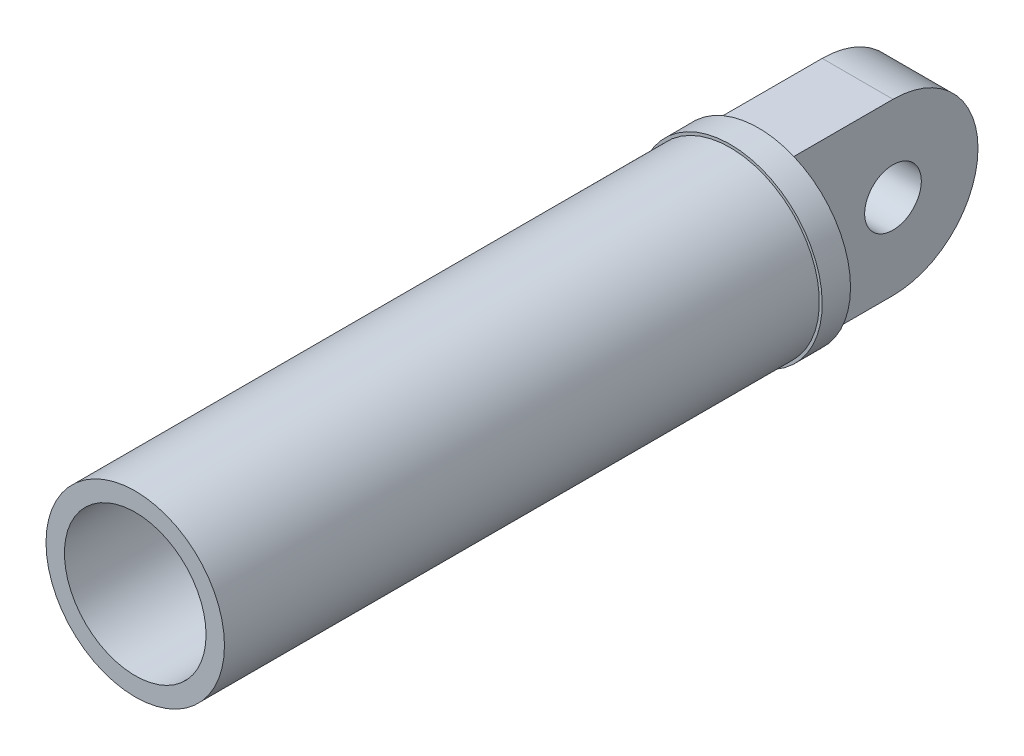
from build123d import *

# Parameters (mm, degrees)
SKETCH_1_R      = 31.5
SKETCH_1_R_2    = 25
EXTRUDE_1_DEPTH = 210
SKETCH_2_R      = 32.5
EXTRUDE_2_DEPTH = 10
SKETCH_3_R      = 10
EXTRUDE_3_DEPTH = 12.5
SKETCH_4_R      = 25
EXTRUDE_4_DEPTH = 10


with BuildPart() as part:
    # Sketch 1 → Extrude 1 (new body)
    with BuildSketch(Plane.XY):
        Circle(SKETCH_1_R)
        Circle(SKETCH_1_R_2, mode=Mode.SUBTRACT)
    extrude(amount=EXTRUDE_1_DEPTH)

    # Sketch 2 → Extrude 2 (add)
    with BuildSketch(Plane(origin=(0, 0, 0), x_dir=(-1, 0, 0), z_dir=(0, 0, -1))):
        Circle(SKETCH_2_R)
    extrude(amount=EXTRUDE_2_DEPTH)

    # Sketch 3 → Extrude 3 (add, symmetric)
    with BuildSketch(Plane(origin=(0, 0, 0), x_dir=(0, 0, -1), z_dir=(1, 0, 0))):
        with BuildLine():
            Line((45, 30), (10, 30))
            Line((10, 30), (10, -30))
            Line((10, -30), (45, -30))
            ThreePointArc((45, -30), (75, 0), (45, 30))
        make_face()
        with Locations((45, 0)):
            Circle(SKETCH_3_R, mode=Mode.SUBTRACT)
    extrude(amount=EXTRUDE_3_DEPTH, both=True)

    # Sketch 4 → Extrude 4 (add)
    with BuildSketch(Plane.XY):
        Circle(SKETCH_4_R)
    extrude(amount=EXTRUDE_4_DEPTH)


solid = part.part
